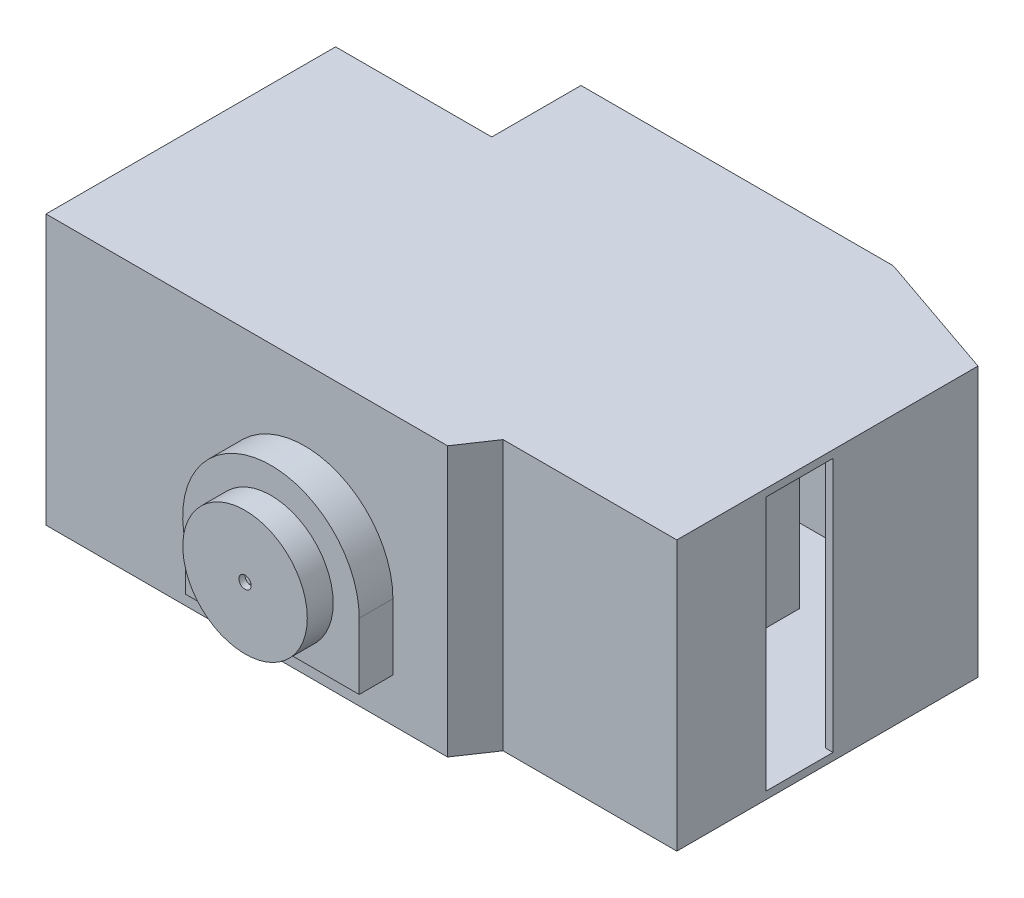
from build123d import *

# Parameters (mm, degrees)
EXTRUDE5_DEPTH   = 3479.8
EXTRUDE5_2_DEPTH = 3479.8
EXTRUDE5_3_DEPTH = 3479.8
EXTRUDE6_DEPTH   = 101.6
EXTRUDE7_DEPTH   = 101.6
EXTRUDE8_DEPTH   = 460.0575
SKETCH5_R        = 850.392
EXTRUDE9_DEPTH   = 353.9998
EXTRUDE10_DEPTH  = 546.1
SKETCH7_R        = 748.792
EXTRUDE11_DEPTH  = 285.75
SKETCH8_R        = 84.1375
EXTRUDE12_DEPTH  = 10696.653832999
SKETCH9_W        = 114.3
SKETCH9_H        = 3752.940605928
EXTRUDE13_DEPTH  = 3479.8


with BuildPart() as part:
    # Sketch1 → Extrude5 (new body)
    with BuildSketch(Plane(origin=(0, 0, 0), x_dir=(1, 0, 0), z_dir=(0, 1, 0))):
        Polygon((101.6, 101.6), (101.6, 1524), (0, 1524), (0, 0), (5486.4, 0), (5791.775244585, 452.737418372), (8166.675244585, 452.737418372), (8166.675244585, 1671.937418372), (8065.075244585, 1671.937418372), (8065.075244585, 554.337418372), (6236.275244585, 554.337418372), (6236.275244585, 4059.537418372), (6134.675244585, 4059.537418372), (6134.675244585, 554.337418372), (5737.753566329, 554.337418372), (5432.378321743, 101.6), align=None)
    extrude(amount=EXTRUDE5_DEPTH)



with BuildPart() as body_2:
    # Sketch1 → Extrude5 2 (new body)
    with BuildSketch(Plane(origin=(0, 0, 0), x_dir=(1, 0, 0), z_dir=(0, 1, 0))):
        Polygon((8166.675244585, 2586.337418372), (8166.675244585, 4567.537418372), (6401.486615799, 5175.340605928), (5029.886615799, 5175.340605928), (5029.886615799, 5073.740605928), (6134.675244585, 5073.740605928), (6134.675244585, 4973.937418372), (6236.275244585, 4973.937418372), (6236.275244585, 5073.740605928), (6384.484606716, 5073.740605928), (8065.075244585, 4495.066842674), (8065.075244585, 2586.337418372), align=None)
    extrude(amount=EXTRUDE5_2_DEPTH)


with BuildPart() as body_3:
    # Sketch1 → Extrude5 3 (new body)
    with BuildSketch(Plane(origin=(0, 0, 0), x_dir=(1, 0, 0), z_dir=(0, 1, 0))):
        Polygon((3201.086615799, 5175.340605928), (2134.286615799, 5175.340605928), (2134.286615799, 3956.140605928), (0.686615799, 3956.140605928), (0.686615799, 2432.140605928), (102.286615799, 2432.140605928), (102.286615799, 3854.540605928), (2235.886615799, 3854.540605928), (2235.886615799, 5073.740605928), (3201.086615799, 5073.740605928), align=None)
    extrude(amount=EXTRUDE5_3_DEPTH)


with BuildPart() as part_1:
    add(part.part)

    add(body_2.part)  # Extrude6 merges body 2

    add(body_3.part)  # Extrude6 merges body 3
    # Sketch2 → Extrude6 (add)
    with BuildSketch(Plane(origin=(0, 3479.8, 0), x_dir=(1, 0, 0), z_dir=(0, 1, 0))):
        Polygon((0.686615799, 3956.140605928), (2134.286615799, 3956.140605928), (2134.286615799, 5175.340605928), (6401.486615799, 5175.340605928), (8166.675244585, 4567.537418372), (8166.675244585, 452.737418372), (5791.775244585, 452.737418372), (5486.4, 0), (0, 0), align=None)
    extrude(amount=EXTRUDE6_DEPTH)

    # Sketch3 → Extrude7 (add)
    with BuildSketch(Plane.XZ):
        Polygon((8166.675244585, -452.737418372), (5791.775244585, -452.737418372), (5486.4, 0), (0, 0), (0.686615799, -3956.140605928), (2134.286615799, -3956.140605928), (2134.286615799, -5175.340605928), (6401.486615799, -5175.340605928), (8166.675244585, -4567.537418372), align=None)
    extrude(amount=EXTRUDE7_DEPTH)

    # Sketch4 → Extrude8 (add)
    with BuildSketch(Plane.XY):
        with BuildLine():
            Line((4739.775, 1398.399999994), (4739.775, 495.3))
            Line((4739.775, 495.3), (2368.55, 495.3))
            Line((2368.55, 495.3), (2368.55, 1087.455150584))
            ThreePointArc((2368.55, 1087.455150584), (3376.971540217, 2594.162800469), (4739.775, 1398.399999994))
        make_face()
    extrude(amount=EXTRUDE8_DEPTH)

    # Sketch5 → Extrude9 (add)
    with BuildSketch(Plane.XY.offset(460.0575)):
        with Locations((3533.775, 1398.399999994)):
            Circle(SKETCH5_R)
    extrude(amount=EXTRUDE9_DEPTH)

    # Sketch6 → Extrude10 (cut)
    with BuildSketch(Plane(origin=(0, 0, -101.6), x_dir=(-1, 0, 0), z_dir=(0, 0, -1))):
        with BuildLine():
            Line((-4286.808908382, 590.55), (-2780.741091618, 590.55))
            ThreePointArc((-2780.741091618, 590.55), (-3533.775, 2502.791999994), (-4286.808908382, 590.55))
        make_face()
    extrude(amount=-EXTRUDE10_DEPTH, mode=Mode.SUBTRACT)

    # Sketch7 → Extrude11 (cut)
    with BuildSketch(Plane(origin=(0, 0, 444.5), x_dir=(-1, 0, 0), z_dir=(0, 0, -1))):
        with Locations((-3533.775, 1398.399999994)):
            Circle(SKETCH7_R)
    extrude(amount=-EXTRUDE11_DEPTH, mode=Mode.SUBTRACT)

    # Sketch8 → Extrude12 (cut, through all)
    with BuildSketch(Plane(origin=(0, 0, 730.25), x_dir=(-1, 0, 0), z_dir=(0, 0, -1))):
        with Locations((-3533.775, 1398.399999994)):
            Circle(SKETCH8_R)
    extrude(amount=-EXTRUDE12_DEPTH, mode=Mode.SUBTRACT)

    # Sketch9 → Extrude13 (add)
    with BuildSketch(Plane(origin=(0, 0, 0), x_dir=(1, 0, 0), z_dir=(0, 1, 0))):
        with Locations((1009.65, 1978.070302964)):
            Rectangle(SKETCH9_W, SKETCH9_H)
    extrude(amount=EXTRUDE13_DEPTH)


solid = part_1.part
